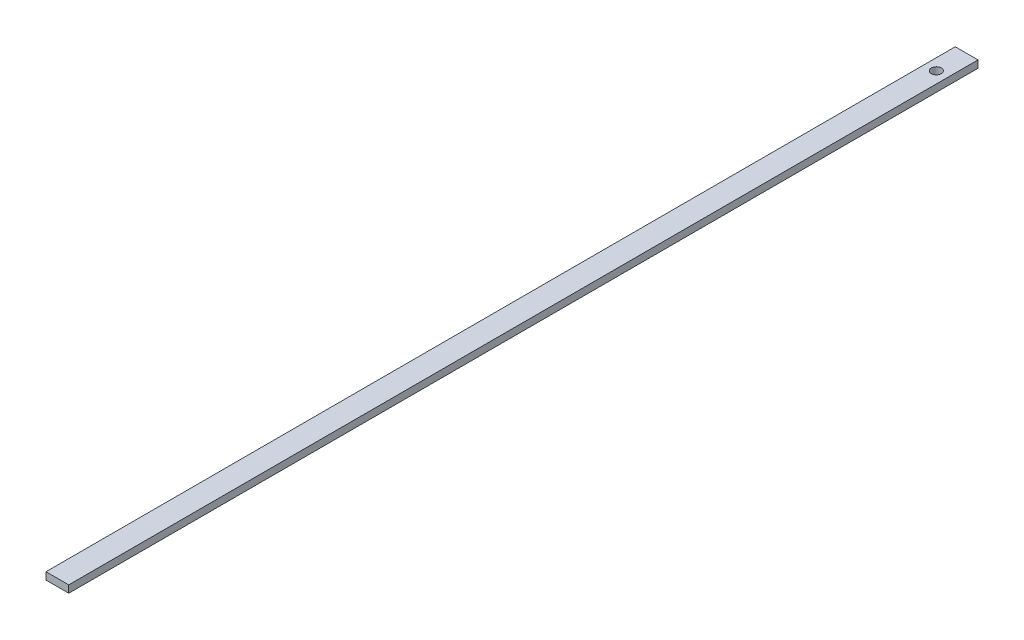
ISO-10303-21;
HEADER;
FILE_DESCRIPTION(('STEP AP214'),'2;1');
FILE_NAME('part.step','',(''),(''),'','','');
FILE_SCHEMA(('AUTOMOTIVE_DESIGN { 1 0 10303 214 1 1 1 1 }'));
ENDSEC;
DATA;
#1=APPLICATION_CONTEXT('core data for automotive mechanical design processes');
#2=APPLICATION_PROTOCOL_DEFINITION('international standard','automotive_design',2000,#1);
#3=PRODUCT_CONTEXT('',#1,'mechanical');
#4=PRODUCT('Part','Part','',(#3));
#5=PRODUCT_RELATED_PRODUCT_CATEGORY('part','',(#4));
#6=PRODUCT_DEFINITION_FORMATION('','',#4);
#7=PRODUCT_DEFINITION_CONTEXT('part definition',#1,'design');
#8=PRODUCT_DEFINITION('design','',#6,#7);
#9=PRODUCT_DEFINITION_SHAPE('','',#8);
#10=(LENGTH_UNIT() NAMED_UNIT(*) SI_UNIT(.MILLI.,.METRE.));
#11=(NAMED_UNIT(*) PLANE_ANGLE_UNIT() SI_UNIT($,.RADIAN.));
#12=(NAMED_UNIT(*) SI_UNIT($,.STERADIAN.) SOLID_ANGLE_UNIT());
#13=UNCERTAINTY_MEASURE_WITH_UNIT(LENGTH_MEASURE(1.E-05),#10,'distance_accuracy_value','');
#14=(GEOMETRIC_REPRESENTATION_CONTEXT(3) GLOBAL_UNCERTAINTY_ASSIGNED_CONTEXT((#13)) GLOBAL_UNIT_ASSIGNED_CONTEXT((#10,
#11,#12)) REPRESENTATION_CONTEXT('',''));
#15=CARTESIAN_POINT('',(0.,0.,0.));
#16=DIRECTION('',(0.,0.,1.));
#17=DIRECTION('',(1.,0.,0.));
#18=AXIS2_PLACEMENT_3D('',#15,#16,#17);
#19=CARTESIAN_POINT('',(-6.03683769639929E-13,0.,299.999999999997));
#20=DIRECTION('',(1.,0.,0.));
#21=DIRECTION('',(0.,0.,-1.));
#22=AXIS2_PLACEMENT_3D('',#19,#20,#21);
#23=PLANE('',#22);
#24=DIRECTION('',(0.,-1.,0.));
#25=VECTOR('',#24,1.);
#26=CARTESIAN_POINT('',(0.,0.,0.));
#27=LINE('',#26,#25);
#28=CARTESIAN_POINT('',(0.,2.39999999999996,0.));
#29=VERTEX_POINT('',#28);
#30=CARTESIAN_POINT('',(0.,0.,0.));
#31=VERTEX_POINT('',#30);
#32=EDGE_CURVE('E392',#29,#31,#27,.T.);
#33=ORIENTED_EDGE('',*,*,#32,.T.);
#34=DIRECTION('',(0.,0.,-1.));
#35=VECTOR('',#34,1.);
#36=CARTESIAN_POINT('',(-6.03683769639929E-13,0.,299.999999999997));
#37=LINE('',#36,#35);
#38=CARTESIAN_POINT('',(-6.03683769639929E-13,0.,299.999999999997));
#39=VERTEX_POINT('',#38);
#40=EDGE_CURVE('E11',#39,#31,#37,.T.);
#41=ORIENTED_EDGE('',*,*,#40,.F.);
#42=DIRECTION('',(0.,-1.,0.));
#43=VECTOR('',#42,1.);
#44=CARTESIAN_POINT('',(-6.03683769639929E-13,0.,299.999999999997));
#45=LINE('',#44,#43);
#46=CARTESIAN_POINT('',(-6.03683769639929E-13,2.39999999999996,299.999999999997));
#47=VERTEX_POINT('',#46);
#48=EDGE_CURVE('E415',#47,#39,#45,.T.);
#49=ORIENTED_EDGE('',*,*,#48,.F.);
#50=DIRECTION('',(0.,0.,-1.));
#51=VECTOR('',#50,1.);
#52=CARTESIAN_POINT('',(-6.03683769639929E-13,2.39999999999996,299.999999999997));
#53=LINE('',#52,#51);
#54=EDGE_CURVE('E404',#47,#29,#53,.T.);
#55=ORIENTED_EDGE('',*,*,#54,.T.);
#56=EDGE_LOOP('',(#33,#41,#49,#55));
#57=FACE_BOUND('',#56,.T.);
#58=ADVANCED_FACE('F348',(#57),#23,.F.);
#59=CARTESIAN_POINT('',(-6.03683769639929E-13,0.,299.999999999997));
#60=DIRECTION('',(0.,1.,0.));
#61=DIRECTION('',(0.,0.,1.));
#62=AXIS2_PLACEMENT_3D('',#59,#60,#61);
#63=PLANE('',#62);
#64=CARTESIAN_POINT('',(3.75,0.,10.));
#65=DIRECTION('',(0.,1.,0.));
#66=DIRECTION('',(0.,0.,1.));
#67=AXIS2_PLACEMENT_3D('',#64,#65,#66);
#68=CIRCLE('',#67,1.65);
#69=CARTESIAN_POINT('',(3.75,0.,11.65));
#70=VERTEX_POINT('',#69);
#71=EDGE_CURVE('E405',#70,#70,#68,.T.);
#72=ORIENTED_EDGE('',*,*,#71,.T.);
#73=EDGE_LOOP('',(#72));
#74=FACE_BOUND('',#73,.T.);
#75=DIRECTION('',(1.,0.,0.));
#76=VECTOR('',#75,1.);
#77=CARTESIAN_POINT('',(0.,0.,0.));
#78=LINE('',#77,#76);
#79=CARTESIAN_POINT('',(7.5,0.,0.));
#80=VERTEX_POINT('',#79);
#81=EDGE_CURVE('E388',#31,#80,#78,.T.);
#82=ORIENTED_EDGE('',*,*,#81,.T.);
#83=DIRECTION('',(0.,0.,-1.));
#84=VECTOR('',#83,1.);
#85=CARTESIAN_POINT('',(7.4999999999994,0.,299.999999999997));
#86=LINE('',#85,#84);
#87=CARTESIAN_POINT('',(7.4999999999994,0.,299.999999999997));
#88=VERTEX_POINT('',#87);
#89=EDGE_CURVE('E355',#88,#80,#86,.T.);
#90=ORIENTED_EDGE('',*,*,#89,.F.);
#91=DIRECTION('',(1.,0.,0.));
#92=VECTOR('',#91,1.);
#93=CARTESIAN_POINT('',(-6.03683769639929E-13,0.,299.999999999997));
#94=LINE('',#93,#92);
#95=EDGE_CURVE('E400',#39,#88,#94,.T.);
#96=ORIENTED_EDGE('',*,*,#95,.F.);
#97=ORIENTED_EDGE('',*,*,#40,.T.);
#98=EDGE_LOOP('',(#82,#90,#96,#97));
#99=FACE_BOUND('',#98,.T.);
#100=ADVANCED_FACE('F399',(#74,#99),#63,.F.);
#101=CARTESIAN_POINT('',(7.4999999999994,0.,299.999999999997));
#102=DIRECTION('',(-1.,0.,0.));
#103=DIRECTION('',(0.,0.,1.));
#104=AXIS2_PLACEMENT_3D('',#101,#102,#103);
#105=PLANE('',#104);
#106=DIRECTION('',(0.,1.,0.));
#107=VECTOR('',#106,1.);
#108=CARTESIAN_POINT('',(7.5,0.,0.));
#109=LINE('',#108,#107);
#110=CARTESIAN_POINT('',(7.5,2.39999999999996,0.));
#111=VERTEX_POINT('',#110);
#112=EDGE_CURVE('E393',#80,#111,#109,.T.);
#113=ORIENTED_EDGE('',*,*,#112,.T.);
#114=DIRECTION('',(0.,0.,-1.));
#115=VECTOR('',#114,1.);
#116=CARTESIAN_POINT('',(7.4999999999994,2.39999999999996,299.999999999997));
#117=LINE('',#116,#115);
#118=CARTESIAN_POINT('',(7.4999999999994,2.39999999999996,299.999999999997));
#119=VERTEX_POINT('',#118);
#120=EDGE_CURVE('E421',#119,#111,#117,.T.);
#121=ORIENTED_EDGE('',*,*,#120,.F.);
#122=DIRECTION('',(0.,1.,0.));
#123=VECTOR('',#122,1.);
#124=CARTESIAN_POINT('',(7.4999999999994,0.,299.999999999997));
#125=LINE('',#124,#123);
#126=EDGE_CURVE('E367',#88,#119,#125,.T.);
#127=ORIENTED_EDGE('',*,*,#126,.F.);
#128=ORIENTED_EDGE('',*,*,#89,.T.);
#129=EDGE_LOOP('',(#113,#121,#127,#128));
#130=FACE_BOUND('',#129,.T.);
#131=ADVANCED_FACE('F424',(#130),#105,.F.);
#132=CARTESIAN_POINT('',(-6.03683769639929E-13,2.39999999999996,299.999999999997));
#133=DIRECTION('',(0.,-1.,0.));
#134=DIRECTION('',(0.,0.,-1.));
#135=AXIS2_PLACEMENT_3D('',#132,#133,#134);
#136=PLANE('',#135);
#137=CARTESIAN_POINT('',(3.74999999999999,2.39999999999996,10.));
#138=DIRECTION('',(0.,1.,0.));
#139=DIRECTION('',(0.,0.,1.));
#140=AXIS2_PLACEMENT_3D('',#137,#138,#139);
#141=CIRCLE('',#140,1.64999999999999);
#142=CARTESIAN_POINT('',(3.74999999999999,2.39999999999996,11.65));
#143=VERTEX_POINT('',#142);
#144=EDGE_CURVE('E408',#143,#143,#141,.T.);
#145=ORIENTED_EDGE('',*,*,#144,.F.);
#146=EDGE_LOOP('',(#145));
#147=FACE_BOUND('',#146,.T.);
#148=DIRECTION('',(-1.,0.,0.));
#149=VECTOR('',#148,1.);
#150=CARTESIAN_POINT('',(0.,2.39999999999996,0.));
#151=LINE('',#150,#149);
#152=EDGE_CURVE('E413',#111,#29,#151,.T.);
#153=ORIENTED_EDGE('',*,*,#152,.T.);
#154=ORIENTED_EDGE('',*,*,#54,.F.);
#155=DIRECTION('',(-1.,0.,0.));
#156=VECTOR('',#155,1.);
#157=CARTESIAN_POINT('',(-6.03683769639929E-13,2.39999999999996,299.999999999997));
#158=LINE('',#157,#156);
#159=EDGE_CURVE('E362',#119,#47,#158,.T.);
#160=ORIENTED_EDGE('',*,*,#159,.F.);
#161=ORIENTED_EDGE('',*,*,#120,.T.);
#162=EDGE_LOOP('',(#153,#154,#160,#161));
#163=FACE_BOUND('',#162,.T.);
#164=ADVANCED_FACE('F426',(#147,#163),#136,.F.);
#165=CARTESIAN_POINT('',(-6.03683769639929E-13,2.39999999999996,299.999999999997));
#166=DIRECTION('',(0.,0.,-1.));
#167=DIRECTION('',(-1.,0.,0.));
#168=AXIS2_PLACEMENT_3D('',#165,#166,#167);
#169=PLANE('',#168);
#170=ORIENTED_EDGE('',*,*,#48,.T.);
#171=ORIENTED_EDGE('',*,*,#95,.T.);
#172=ORIENTED_EDGE('',*,*,#126,.T.);
#173=ORIENTED_EDGE('',*,*,#159,.T.);
#174=EDGE_LOOP('',(#170,#171,#172,#173));
#175=FACE_BOUND('',#174,.T.);
#176=ADVANCED_FACE('F427',(#175),#169,.F.);
#177=CARTESIAN_POINT('',(0.,2.39999999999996,0.));
#178=DIRECTION('',(0.,0.,-1.));
#179=DIRECTION('',(-1.,0.,0.));
#180=AXIS2_PLACEMENT_3D('',#177,#178,#179);
#181=PLANE('',#180);
#182=ORIENTED_EDGE('',*,*,#32,.F.);
#183=ORIENTED_EDGE('',*,*,#152,.F.);
#184=ORIENTED_EDGE('',*,*,#112,.F.);
#185=ORIENTED_EDGE('',*,*,#81,.F.);
#186=EDGE_LOOP('',(#182,#183,#184,#185));
#187=FACE_BOUND('',#186,.T.);
#188=ADVANCED_FACE('F389',(#187),#181,.T.);
#189=CARTESIAN_POINT('',(3.74999999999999,2.39999999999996,10.));
#190=DIRECTION('',(0.,1.,0.));
#191=DIRECTION('',(0.,0.,1.));
#192=AXIS2_PLACEMENT_3D('',#189,#190,#191);
#193=CYLINDRICAL_SURFACE('',#192,1.64999999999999);
#194=ORIENTED_EDGE('',*,*,#71,.F.);
#195=EDGE_LOOP('',(#194));
#196=FACE_BOUND('',#195,.T.);
#197=ORIENTED_EDGE('',*,*,#144,.T.);
#198=EDGE_LOOP('',(#197));
#199=FACE_BOUND('',#198,.T.);
#200=ADVANCED_FACE('F434',(#196,#199),#193,.F.);
#201=CLOSED_SHELL('',(#58,#100,#131,#164,#176,#188,#200));
#202=MANIFOLD_SOLID_BREP('B2',#201);
#203=ADVANCED_BREP_SHAPE_REPRESENTATION('',(#18,#202),#14);
#204=SHAPE_DEFINITION_REPRESENTATION(#9,#203);
ENDSEC;
END-ISO-10303-21;
